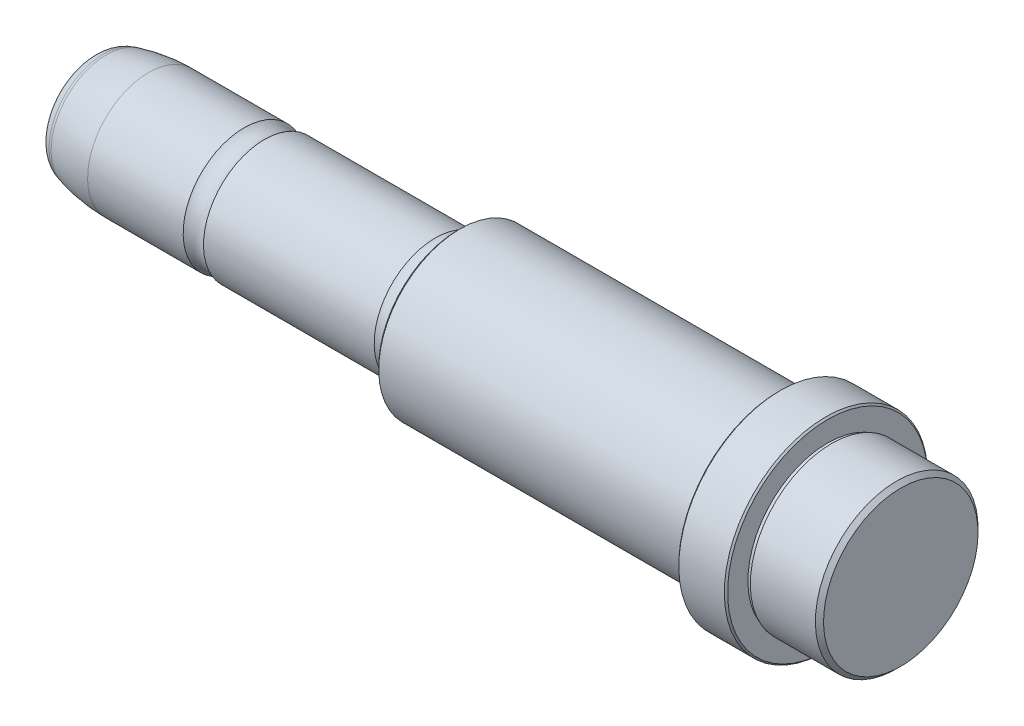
ISO-10303-21;
HEADER;
FILE_DESCRIPTION(('STEP AP214'),'2;1');
FILE_NAME('part.step','',(''),(''),'','','');
FILE_SCHEMA(('AUTOMOTIVE_DESIGN { 1 0 10303 214 1 1 1 1 }'));
ENDSEC;
DATA;
#1=APPLICATION_CONTEXT('core data for automotive mechanical design processes');
#2=APPLICATION_PROTOCOL_DEFINITION('international standard','automotive_design',2000,#1);
#3=PRODUCT_CONTEXT('',#1,'mechanical');
#4=PRODUCT('Part','Part','',(#3));
#5=PRODUCT_RELATED_PRODUCT_CATEGORY('part','',(#4));
#6=PRODUCT_DEFINITION_FORMATION('','',#4);
#7=PRODUCT_DEFINITION_CONTEXT('part definition',#1,'design');
#8=PRODUCT_DEFINITION('design','',#6,#7);
#9=PRODUCT_DEFINITION_SHAPE('','',#8);
#10=(LENGTH_UNIT() NAMED_UNIT(*) SI_UNIT(.MILLI.,.METRE.));
#11=(NAMED_UNIT(*) PLANE_ANGLE_UNIT() SI_UNIT($,.RADIAN.));
#12=(NAMED_UNIT(*) SI_UNIT($,.STERADIAN.) SOLID_ANGLE_UNIT());
#13=UNCERTAINTY_MEASURE_WITH_UNIT(LENGTH_MEASURE(1.E-05),#10,'distance_accuracy_value','');
#14=(GEOMETRIC_REPRESENTATION_CONTEXT(3) GLOBAL_UNCERTAINTY_ASSIGNED_CONTEXT((#13)) GLOBAL_UNIT_ASSIGNED_CONTEXT((#10,
#11,#12)) REPRESENTATION_CONTEXT('',''));
#15=CARTESIAN_POINT('',(0.,0.,0.));
#16=DIRECTION('',(0.,0.,1.));
#17=DIRECTION('',(1.,0.,0.));
#18=AXIS2_PLACEMENT_3D('',#15,#16,#17);
#19=CARTESIAN_POINT('',(54.7,64.7500000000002,-78.0000000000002));
#20=DIRECTION('',(1.,0.,0.));
#21=DIRECTION('',(0.,0.,-1.));
#22=AXIS2_PLACEMENT_3D('',#19,#20,#21);
#23=PLANE('',#22);
#24=CARTESIAN_POINT('',(54.7,60.0000000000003,-78.0000000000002));
#25=DIRECTION('',(1.,0.,0.));
#26=DIRECTION('',(0.,1.,0.));
#27=AXIS2_PLACEMENT_3D('',#24,#25,#26);
#28=CIRCLE('',#27,9.5);
#29=CARTESIAN_POINT('',(54.7,69.5000000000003,-78.0000000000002));
#30=VERTEX_POINT('',#29);
#31=EDGE_CURVE('E8',#30,#30,#28,.T.);
#32=ORIENTED_EDGE('',*,*,#31,.T.);
#33=EDGE_LOOP('',(#32));
#34=FACE_BOUND('',#33,.T.);
#35=ADVANCED_FACE('F12',(#34),#23,.T.);
#36=DIRECTION('',(0.707106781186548,-0.707106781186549,0.));
#37=VECTOR('',#36,1.);
#38=CARTESIAN_POINT('',(54.45,69.7500000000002,-78.0000000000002));
#39=LINE('',#38,#37);
#40=CARTESIAN_POINT('',(64.2000000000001,60.0000000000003,-78.0000000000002));
#41=DIRECTION('',(-1.,0.,0.));
#42=AXIS1_PLACEMENT('',#40,#41);
#43=SURFACE_OF_REVOLUTION('',#39,#42);
#44=CARTESIAN_POINT('',(54.2,60.0000000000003,-78.0000000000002));
#45=DIRECTION('',(1.,0.,0.));
#46=DIRECTION('',(0.,1.,0.));
#47=AXIS2_PLACEMENT_3D('',#44,#45,#46);
#48=CIRCLE('',#47,10.);
#49=CARTESIAN_POINT('',(54.2,70.0000000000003,-78.0000000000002));
#50=VERTEX_POINT('',#49);
#51=EDGE_CURVE('E85',#50,#50,#48,.T.);
#52=ORIENTED_EDGE('',*,*,#51,.T.);
#53=EDGE_LOOP('',(#52));
#54=FACE_BOUND('',#53,.T.);
#55=ORIENTED_EDGE('',*,*,#31,.F.);
#56=EDGE_LOOP('',(#55));
#57=FACE_BOUND('',#56,.T.);
#58=ADVANCED_FACE('F111',(#54,#57),#43,.F.);
#59=CARTESIAN_POINT('',(50.2,60.0000000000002,-78.0000000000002));
#60=DIRECTION('',(-1.,0.,0.));
#61=DIRECTION('',(0.,0.,1.));
#62=AXIS2_PLACEMENT_3D('',#59,#60,#61);
#63=CYLINDRICAL_SURFACE('',#62,10.);
#64=CARTESIAN_POINT('',(46.2,60.0000000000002,-78.0000000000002));
#65=DIRECTION('',(1.,0.,0.));
#66=DIRECTION('',(0.,1.,0.));
#67=AXIS2_PLACEMENT_3D('',#64,#65,#66);
#68=CIRCLE('',#67,10.);
#69=CARTESIAN_POINT('',(46.2,70.0000000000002,-78.0000000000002));
#70=VERTEX_POINT('',#69);
#71=EDGE_CURVE('E55',#70,#70,#68,.T.);
#72=ORIENTED_EDGE('',*,*,#71,.T.);
#73=EDGE_LOOP('',(#72));
#74=FACE_BOUND('',#73,.T.);
#75=ORIENTED_EDGE('',*,*,#51,.F.);
#76=EDGE_LOOP('',(#75));
#77=FACE_BOUND('',#76,.T.);
#78=ADVANCED_FACE('F115',(#74,#77),#63,.T.);
#79=CARTESIAN_POINT('',(46.2,69.9000000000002,-78.0000000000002));
#80=DIRECTION('',(-1.,0.,0.));
#81=DIRECTION('',(0.,0.,1.));
#82=AXIS2_PLACEMENT_3D('',#79,#80,#81);
#83=PLANE('',#82);
#84=CARTESIAN_POINT('',(46.2,60.0000000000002,-78.0000000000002));
#85=DIRECTION('',(1.,0.,0.));
#86=DIRECTION('',(0.,1.,0.));
#87=AXIS2_PLACEMENT_3D('',#84,#85,#86);
#88=CIRCLE('',#87,9.8);
#89=CARTESIAN_POINT('',(46.2,69.8000000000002,-78.0000000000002));
#90=VERTEX_POINT('',#89);
#91=EDGE_CURVE('E21',#90,#90,#88,.T.);
#92=ORIENTED_EDGE('',*,*,#91,.T.);
#93=EDGE_LOOP('',(#92));
#94=FACE_BOUND('',#93,.T.);
#95=ORIENTED_EDGE('',*,*,#71,.F.);
#96=EDGE_LOOP('',(#95));
#97=FACE_BOUND('',#96,.T.);
#98=ADVANCED_FACE('F119',(#94,#97),#83,.T.);
#99=CARTESIAN_POINT('',(45.95,60.0000000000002,-78.0000000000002));
#100=DIRECTION('',(-1.,0.,0.));
#101=DIRECTION('',(0.,0.,1.));
#102=AXIS2_PLACEMENT_3D('',#99,#100,#101);
#103=CYLINDRICAL_SURFACE('',#102,9.8);
#104=CARTESIAN_POINT('',(45.7,60.0000000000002,-78.0000000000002));
#105=DIRECTION('',(1.,0.,0.));
#106=DIRECTION('',(0.,1.,0.));
#107=AXIS2_PLACEMENT_3D('',#104,#105,#106);
#108=CIRCLE('',#107,9.8);
#109=CARTESIAN_POINT('',(45.7,69.8000000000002,-78.0000000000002));
#110=VERTEX_POINT('',#109);
#111=EDGE_CURVE('E30',#110,#110,#108,.T.);
#112=ORIENTED_EDGE('',*,*,#111,.T.);
#113=EDGE_LOOP('',(#112));
#114=FACE_BOUND('',#113,.T.);
#115=ORIENTED_EDGE('',*,*,#91,.F.);
#116=EDGE_LOOP('',(#115));
#117=FACE_BOUND('',#116,.T.);
#118=ADVANCED_FACE('F123',(#114,#117),#103,.T.);
#119=CARTESIAN_POINT('',(45.7,71.0500000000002,-78.0000000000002));
#120=DIRECTION('',(1.,0.,0.));
#121=DIRECTION('',(0.,0.,-1.));
#122=AXIS2_PLACEMENT_3D('',#119,#120,#121);
#123=PLANE('',#122);
#124=CARTESIAN_POINT('',(45.7,60.0000000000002,-78.0000000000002));
#125=DIRECTION('',(1.,0.,0.));
#126=DIRECTION('',(0.,1.,0.));
#127=AXIS2_PLACEMENT_3D('',#124,#125,#126);
#128=CIRCLE('',#127,12.3);
#129=CARTESIAN_POINT('',(45.7,72.3000000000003,-78.0000000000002));
#130=VERTEX_POINT('',#129);
#131=EDGE_CURVE('E40',#130,#130,#128,.T.);
#132=ORIENTED_EDGE('',*,*,#131,.T.);
#133=EDGE_LOOP('',(#132));
#134=FACE_BOUND('',#133,.T.);
#135=ORIENTED_EDGE('',*,*,#111,.F.);
#136=EDGE_LOOP('',(#135));
#137=FACE_BOUND('',#136,.T.);
#138=ADVANCED_FACE('F127',(#134,#137),#123,.T.);
#139=DIRECTION('',(0.707106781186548,-0.707106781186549,0.));
#140=VECTOR('',#139,1.);
#141=CARTESIAN_POINT('',(45.6,72.4000000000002,-78.0000000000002));
#142=LINE('',#141,#140);
#143=CARTESIAN_POINT('',(58.,60.0000000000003,-78.0000000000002));
#144=DIRECTION('',(-1.,0.,0.));
#145=AXIS1_PLACEMENT('',#143,#144);
#146=SURFACE_OF_REVOLUTION('',#142,#145);
#147=CARTESIAN_POINT('',(45.5,60.0000000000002,-78.0000000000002));
#148=DIRECTION('',(1.,0.,0.));
#149=DIRECTION('',(0.,1.,0.));
#150=AXIS2_PLACEMENT_3D('',#147,#148,#149);
#151=CIRCLE('',#150,12.5);
#152=CARTESIAN_POINT('',(45.5,72.5000000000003,-78.0000000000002));
#153=VERTEX_POINT('',#152);
#154=EDGE_CURVE('E36',#153,#153,#151,.T.);
#155=ORIENTED_EDGE('',*,*,#154,.T.);
#156=EDGE_LOOP('',(#155));
#157=FACE_BOUND('',#156,.T.);
#158=ORIENTED_EDGE('',*,*,#131,.F.);
#159=EDGE_LOOP('',(#158));
#160=FACE_BOUND('',#159,.T.);
#161=ADVANCED_FACE('F131',(#157,#160),#146,.F.);
#162=CARTESIAN_POINT('',(42.7,60.0000000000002,-78.0000000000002));
#163=DIRECTION('',(-1.,0.,0.));
#164=DIRECTION('',(0.,0.,1.));
#165=AXIS2_PLACEMENT_3D('',#162,#163,#164);
#166=CYLINDRICAL_SURFACE('',#165,12.5);
#167=CARTESIAN_POINT('',(39.9,60.0000000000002,-78.0000000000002));
#168=DIRECTION('',(1.,0.,0.));
#169=DIRECTION('',(0.,1.,0.));
#170=AXIS2_PLACEMENT_3D('',#167,#168,#169);
#171=CIRCLE('',#170,12.5);
#172=CARTESIAN_POINT('',(39.9,72.5000000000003,-78.0000000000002));
#173=VERTEX_POINT('',#172);
#174=EDGE_CURVE('E41',#173,#173,#171,.T.);
#175=ORIENTED_EDGE('',*,*,#174,.T.);
#176=EDGE_LOOP('',(#175));
#177=FACE_BOUND('',#176,.T.);
#178=ORIENTED_EDGE('',*,*,#154,.F.);
#179=EDGE_LOOP('',(#178));
#180=FACE_BOUND('',#179,.T.);
#181=ADVANCED_FACE('F135',(#177,#180),#166,.T.);
#182=DIRECTION('',(-0.707106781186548,-0.707106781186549,0.));
#183=VECTOR('',#182,1.);
#184=CARTESIAN_POINT('',(39.8,72.4000000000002,-78.0000000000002));
#185=LINE('',#184,#183);
#186=CARTESIAN_POINT('',(27.4,60.0000000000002,-78.0000000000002));
#187=DIRECTION('',(1.,0.,0.));
#188=AXIS1_PLACEMENT('',#186,#187);
#189=SURFACE_OF_REVOLUTION('',#185,#188);
#190=CARTESIAN_POINT('',(39.7,60.0000000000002,-78.0000000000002));
#191=DIRECTION('',(1.,0.,0.));
#192=DIRECTION('',(0.,1.,0.));
#193=AXIS2_PLACEMENT_3D('',#190,#191,#192);
#194=CIRCLE('',#193,12.3);
#195=CARTESIAN_POINT('',(39.7,72.3000000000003,-78.0000000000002));
#196=VERTEX_POINT('',#195);
#197=EDGE_CURVE('E51',#196,#196,#194,.T.);
#198=ORIENTED_EDGE('',*,*,#197,.T.);
#199=EDGE_LOOP('',(#198));
#200=FACE_BOUND('',#199,.T.);
#201=ORIENTED_EDGE('',*,*,#174,.F.);
#202=EDGE_LOOP('',(#201));
#203=FACE_BOUND('',#202,.T.);
#204=ADVANCED_FACE('F139',(#200,#203),#189,.F.);
#205=CARTESIAN_POINT('',(39.7,71.0500000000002,-78.0000000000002));
#206=DIRECTION('',(-1.,0.,0.));
#207=DIRECTION('',(0.,0.,1.));
#208=AXIS2_PLACEMENT_3D('',#205,#206,#207);
#209=PLANE('',#208);
#210=CARTESIAN_POINT('',(39.7,60.0000000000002,-78.0000000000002));
#211=DIRECTION('',(1.,0.,0.));
#212=DIRECTION('',(0.,1.,0.));
#213=AXIS2_PLACEMENT_3D('',#210,#211,#212);
#214=CIRCLE('',#213,9.8);
#215=CARTESIAN_POINT('',(39.7,69.8000000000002,-78.0000000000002));
#216=VERTEX_POINT('',#215);
#217=EDGE_CURVE('E45',#216,#216,#214,.T.);
#218=ORIENTED_EDGE('',*,*,#217,.T.);
#219=EDGE_LOOP('',(#218));
#220=FACE_BOUND('',#219,.T.);
#221=ORIENTED_EDGE('',*,*,#197,.F.);
#222=EDGE_LOOP('',(#221));
#223=FACE_BOUND('',#222,.T.);
#224=ADVANCED_FACE('F143',(#220,#223),#209,.T.);
#225=CARTESIAN_POINT('',(39.45,60.0000000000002,-78.0000000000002));
#226=DIRECTION('',(-1.,0.,0.));
#227=DIRECTION('',(0.,0.,1.));
#228=AXIS2_PLACEMENT_3D('',#225,#226,#227);
#229=CYLINDRICAL_SURFACE('',#228,9.8);
#230=CARTESIAN_POINT('',(39.2,60.0000000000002,-78.0000000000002));
#231=DIRECTION('',(1.,0.,0.));
#232=DIRECTION('',(0.,1.,0.));
#233=AXIS2_PLACEMENT_3D('',#230,#231,#232);
#234=CIRCLE('',#233,9.8);
#235=CARTESIAN_POINT('',(39.2,69.8000000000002,-78.0000000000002));
#236=VERTEX_POINT('',#235);
#237=EDGE_CURVE('E65',#236,#236,#234,.T.);
#238=ORIENTED_EDGE('',*,*,#237,.T.);
#239=EDGE_LOOP('',(#238));
#240=FACE_BOUND('',#239,.T.);
#241=ORIENTED_EDGE('',*,*,#217,.F.);
#242=EDGE_LOOP('',(#241));
#243=FACE_BOUND('',#242,.T.);
#244=ADVANCED_FACE('F232',(#240,#243),#229,.T.);
#245=CARTESIAN_POINT('',(39.2,69.9000000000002,-78.0000000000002));
#246=DIRECTION('',(1.,0.,0.));
#247=DIRECTION('',(0.,0.,-1.));
#248=AXIS2_PLACEMENT_3D('',#245,#246,#247);
#249=PLANE('',#248);
#250=CARTESIAN_POINT('',(39.2,60.0000000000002,-78.0000000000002));
#251=DIRECTION('',(1.,0.,0.));
#252=DIRECTION('',(0.,1.,0.));
#253=AXIS2_PLACEMENT_3D('',#250,#251,#252);
#254=CIRCLE('',#253,10.);
#255=CARTESIAN_POINT('',(39.2,70.0000000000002,-78.0000000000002));
#256=VERTEX_POINT('',#255);
#257=EDGE_CURVE('E60',#256,#256,#254,.T.);
#258=ORIENTED_EDGE('',*,*,#257,.T.);
#259=EDGE_LOOP('',(#258));
#260=FACE_BOUND('',#259,.T.);
#261=ORIENTED_EDGE('',*,*,#237,.F.);
#262=EDGE_LOOP('',(#261));
#263=FACE_BOUND('',#262,.T.);
#264=ADVANCED_FACE('F238',(#260,#263),#249,.T.);
#265=CARTESIAN_POINT('',(20.7,60.0000000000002,-78.0000000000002));
#266=DIRECTION('',(-1.,0.,0.));
#267=DIRECTION('',(0.,0.,1.));
#268=AXIS2_PLACEMENT_3D('',#265,#266,#267);
#269=CYLINDRICAL_SURFACE('',#268,10.);
#270=CARTESIAN_POINT('',(0.5,60.0000000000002,-78.0000000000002));
#271=DIRECTION('',(1.,0.,0.));
#272=DIRECTION('',(0.,1.,0.));
#273=AXIS2_PLACEMENT_3D('',#270,#271,#272);
#274=CIRCLE('',#273,10.);
#275=CARTESIAN_POINT('',(0.5,70.0000000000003,-78.0000000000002));
#276=VERTEX_POINT('',#275);
#277=EDGE_CURVE('E50',#276,#276,#274,.T.);
#278=ORIENTED_EDGE('',*,*,#277,.T.);
#279=EDGE_LOOP('',(#278));
#280=FACE_BOUND('',#279,.T.);
#281=ORIENTED_EDGE('',*,*,#257,.F.);
#282=EDGE_LOOP('',(#281));
#283=FACE_BOUND('',#282,.T.);
#284=ADVANCED_FACE('F158',(#280,#283),#269,.T.);
#285=DIRECTION('',(-0.707106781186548,-0.707106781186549,0.));
#286=VECTOR('',#285,1.);
#287=CARTESIAN_POINT('',(0.350000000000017,69.8500000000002,-78.0000000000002));
#288=LINE('',#287,#286);
#289=CARTESIAN_POINT('',(-9.49999999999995,60.0000000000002,-78.0000000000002));
#290=DIRECTION('',(1.,0.,0.));
#291=AXIS1_PLACEMENT('',#289,#290);
#292=SURFACE_OF_REVOLUTION('',#288,#291);
#293=CARTESIAN_POINT('',(0.200000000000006,60.0000000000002,-78.0000000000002));
#294=DIRECTION('',(1.,0.,0.));
#295=DIRECTION('',(0.,1.,0.));
#296=AXIS2_PLACEMENT_3D('',#293,#294,#295);
#297=CIRCLE('',#296,9.7);
#298=CARTESIAN_POINT('',(0.200000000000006,69.7000000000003,-78.0000000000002));
#299=VERTEX_POINT('',#298);
#300=EDGE_CURVE('E46',#299,#299,#297,.T.);
#301=ORIENTED_EDGE('',*,*,#300,.T.);
#302=EDGE_LOOP('',(#301));
#303=FACE_BOUND('',#302,.T.);
#304=ORIENTED_EDGE('',*,*,#277,.F.);
#305=EDGE_LOOP('',(#304));
#306=FACE_BOUND('',#305,.T.);
#307=ADVANCED_FACE('F153',(#303,#306),#292,.F.);
#308=CARTESIAN_POINT('',(0.20000000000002,69.5250000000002,-78.0000000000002));
#309=DIRECTION('',(-1.,0.,0.));
#310=DIRECTION('',(0.,0.,1.));
#311=AXIS2_PLACEMENT_3D('',#308,#309,#310);
#312=PLANE('',#311);
#313=CARTESIAN_POINT('',(0.200000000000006,60.0000000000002,-78.0000000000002));
#314=DIRECTION('',(1.,0.,0.));
#315=DIRECTION('',(0.,1.,0.));
#316=AXIS2_PLACEMENT_3D('',#313,#314,#315);
#317=CIRCLE('',#316,9.34999999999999);
#318=CARTESIAN_POINT('',(0.200000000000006,69.3500000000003,-78.0000000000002));
#319=VERTEX_POINT('',#318);
#320=EDGE_CURVE('E56',#319,#319,#317,.T.);
#321=ORIENTED_EDGE('',*,*,#320,.T.);
#322=EDGE_LOOP('',(#321));
#323=FACE_BOUND('',#322,.T.);
#324=ORIENTED_EDGE('',*,*,#300,.F.);
#325=EDGE_LOOP('',(#324));
#326=FACE_BOUND('',#325,.T.);
#327=ADVANCED_FACE('F157',(#323,#326),#312,.T.);
#328=CARTESIAN_POINT('',(-1.79999999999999,60.0000000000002,-78.0000000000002));
#329=DIRECTION('',(1.,0.,0.));
#330=DIRECTION('',(0.,0.,-1.));
#331=AXIS2_PLACEMENT_3D('',#328,#329,#330);
#332=TOROIDAL_SURFACE('',#331,9.34999999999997,2.);
#333=ORIENTED_EDGE('',*,*,#320,.F.);
#334=EDGE_LOOP('',(#333));
#335=FACE_BOUND('',#334,.T.);
#336=CARTESIAN_POINT('',(-2.55993420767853,60.0000000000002,-78.0000000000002));
#337=DIRECTION('',(1.,0.,0.));
#338=DIRECTION('',(0.,1.,0.));
#339=AXIS2_PLACEMENT_3D('',#336,#337,#338);
#340=CIRCLE('',#339,7.5);
#341=CARTESIAN_POINT('',(-2.55993420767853,67.5000000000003,-78.0000000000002));
#342=VERTEX_POINT('',#341);
#343=EDGE_CURVE('E61',#342,#342,#340,.T.);
#344=ORIENTED_EDGE('',*,*,#343,.T.);
#345=EDGE_LOOP('',(#344));
#346=FACE_BOUND('',#345,.T.);
#347=ADVANCED_FACE('F163',(#335,#346),#332,.F.);
#348=CARTESIAN_POINT('',(-13.0549671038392,60.0000000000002,-78.0000000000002));
#349=DIRECTION('',(-1.,0.,0.));
#350=DIRECTION('',(0.,0.,1.));
#351=AXIS2_PLACEMENT_3D('',#348,#349,#350);
#352=CYLINDRICAL_SURFACE('',#351,7.5);
#353=CARTESIAN_POINT('',(-23.55,60.0000000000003,-78.0000000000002));
#354=DIRECTION('',(1.,0.,0.));
#355=DIRECTION('',(0.,1.,0.));
#356=AXIS2_PLACEMENT_3D('',#353,#354,#355);
#357=CIRCLE('',#356,7.5);
#358=CARTESIAN_POINT('',(-23.55,67.5000000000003,-78.0000000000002));
#359=VERTEX_POINT('',#358);
#360=EDGE_CURVE('E72',#359,#359,#357,.T.);
#361=ORIENTED_EDGE('',*,*,#360,.T.);
#362=EDGE_LOOP('',(#361));
#363=FACE_BOUND('',#362,.T.);
#364=ORIENTED_EDGE('',*,*,#343,.F.);
#365=EDGE_LOOP('',(#364));
#366=FACE_BOUND('',#365,.T.);
#367=ADVANCED_FACE('F167',(#363,#366),#352,.T.);
#368=CARTESIAN_POINT('',(-24.8,60.0000000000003,-78.0000000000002));
#369=DIRECTION('',(1.,0.,0.));
#370=DIRECTION('',(0.,0.,-1.));
#371=AXIS2_PLACEMENT_3D('',#368,#369,#370);
#372=TOROIDAL_SURFACE('',#371,9.31038669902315,2.2);
#373=ORIENTED_EDGE('',*,*,#360,.F.);
#374=EDGE_LOOP('',(#373));
#375=FACE_BOUND('',#374,.T.);
#376=CARTESIAN_POINT('',(-26.05,60.0000000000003,-78.0000000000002));
#377=DIRECTION('',(1.,0.,0.));
#378=DIRECTION('',(0.,1.,0.));
#379=AXIS2_PLACEMENT_3D('',#376,#377,#378);
#380=CIRCLE('',#379,7.5);
#381=CARTESIAN_POINT('',(-26.05,67.5000000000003,-78.0000000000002));
#382=VERTEX_POINT('',#381);
#383=EDGE_CURVE('E68',#382,#382,#380,.T.);
#384=ORIENTED_EDGE('',*,*,#383,.T.);
#385=EDGE_LOOP('',(#384));
#386=FACE_BOUND('',#385,.T.);
#387=ADVANCED_FACE('F171',(#375,#386),#372,.F.);
#388=CARTESIAN_POINT('',(-31.925,60.0000000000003,-78.0000000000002));
#389=DIRECTION('',(-1.,0.,0.));
#390=DIRECTION('',(0.,0.,1.));
#391=AXIS2_PLACEMENT_3D('',#388,#389,#390);
#392=CYLINDRICAL_SURFACE('',#391,7.5);
#393=CARTESIAN_POINT('',(-37.8,60.0000000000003,-78.0000000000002));
#394=DIRECTION('',(1.,0.,0.));
#395=DIRECTION('',(0.,1.,0.));
#396=AXIS2_PLACEMENT_3D('',#393,#394,#395);
#397=CIRCLE('',#396,7.5);
#398=CARTESIAN_POINT('',(-37.8,67.5000000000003,-78.0000000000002));
#399=VERTEX_POINT('',#398);
#400=EDGE_CURVE('E33',#399,#399,#397,.T.);
#401=ORIENTED_EDGE('',*,*,#400,.T.);
#402=EDGE_LOOP('',(#401));
#403=FACE_BOUND('',#402,.T.);
#404=ORIENTED_EDGE('',*,*,#383,.F.);
#405=EDGE_LOOP('',(#404));
#406=FACE_BOUND('',#405,.T.);
#407=ADVANCED_FACE('F175',(#403,#406),#392,.T.);
#408=CARTESIAN_POINT('',(-37.7999999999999,60.0000000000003,-65.5000000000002));
#409=DIRECTION('',(0.,1.,0.));
#410=DIRECTION('',(0.,0.,-1.));
#411=AXIS2_PLACEMENT_3D('',#408,#409,#410);
#412=CIRCLE('',#411,20.);
#413=TRIMMED_CURVE('',#412,(PARAMETER_VALUE(-0.895664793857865)),
(PARAMETER_VALUE(0.895664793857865)),.T.,.PARAMETER.);
#414=CARTESIAN_POINT('',(-37.8,60.0000000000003,-78.0000000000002));
#415=DIRECTION('',(1.,0.,0.));
#416=AXIS1_PLACEMENT('',#414,#415);
#417=SURFACE_OF_REVOLUTION('',#413,#416);
#418=CARTESIAN_POINT('',(-42.9763809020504,60.0000000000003,-78.0000000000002));
#419=DIRECTION('',(1.,0.,0.));
#420=DIRECTION('',(0.,1.,0.));
#421=AXIS2_PLACEMENT_3D('',#418,#419,#420);
#422=CIRCLE('',#421,6.81851652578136);
#423=CARTESIAN_POINT('',(-42.9763809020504,66.8185165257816,-78.0000000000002));
#424=VERTEX_POINT('',#423);
#425=EDGE_CURVE('E78',#424,#424,#422,.T.);
#426=ORIENTED_EDGE('',*,*,#425,.T.);
#427=EDGE_LOOP('',(#426));
#428=FACE_BOUND('',#427,.T.);
#429=ORIENTED_EDGE('',*,*,#400,.F.);
#430=EDGE_LOOP('',(#429));
#431=FACE_BOUND('',#430,.T.);
#432=ADVANCED_FACE('F182',(#428,#431),#417,.F.);
#433=DIRECTION('',(-0.965925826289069,-0.25881904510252,0.));
#434=VECTOR('',#433,1.);
#435=CARTESIAN_POINT('',(499000.,133784.981026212,-78.0000000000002));
#436=LINE('',#435,#434);
#437=CARTESIAN_POINT('',(-68.4234310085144,60.0000000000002,-78.0000000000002));
#438=DIRECTION('',(1.,0.,0.));
#439=AXIS1_PLACEMENT('',#437,#438);
#440=SURFACE_OF_REVOLUTION('',#436,#439);
#441=CARTESIAN_POINT('',(-43.317638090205,60.0000000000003,-78.0000000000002));
#442=DIRECTION('',(1.,0.,0.));
#443=DIRECTION('',(0.,1.,0.));
#444=AXIS2_PLACEMENT_3D('',#441,#442,#443);
#445=CIRCLE('',#444,6.72707693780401);
#446=CARTESIAN_POINT('',(-43.317638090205,66.7270769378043,-78.0000000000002));
#447=VERTEX_POINT('',#446);
#448=EDGE_CURVE('E74',#447,#447,#445,.T.);
#449=ORIENTED_EDGE('',*,*,#448,.T.);
#450=EDGE_LOOP('',(#449));
#451=FACE_BOUND('',#450,.T.);
#452=ORIENTED_EDGE('',*,*,#425,.F.);
#453=EDGE_LOOP('',(#452));
#454=FACE_BOUND('',#453,.T.);
#455=ADVANCED_FACE('F185',(#451,#454),#440,.F.);
#456=CARTESIAN_POINT('',(-42.8,60.0000000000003,-78.0000000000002));
#457=DIRECTION('',(1.,0.,0.));
#458=DIRECTION('',(0.,0.,-1.));
#459=AXIS2_PLACEMENT_3D('',#456,#457,#458);
#460=TOROIDAL_SURFACE('',#459,4.79522528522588,2.);
#461=CARTESIAN_POINT('',(-44.8,60.0000000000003,-78.0000000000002));
#462=DIRECTION('',(1.,0.,0.));
#463=DIRECTION('',(0.,1.,0.));
#464=AXIS2_PLACEMENT_3D('',#461,#462,#463);
#465=CIRCLE('',#464,4.79522528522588);
#466=CARTESIAN_POINT('',(-44.8,64.7952252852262,-78.0000000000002));
#467=VERTEX_POINT('',#466);
#468=EDGE_CURVE('E73',#467,#467,#465,.T.);
#469=ORIENTED_EDGE('',*,*,#468,.T.);
#470=EDGE_LOOP('',(#469));
#471=FACE_BOUND('',#470,.T.);
#472=ORIENTED_EDGE('',*,*,#448,.F.);
#473=EDGE_LOOP('',(#472));
#474=FACE_BOUND('',#473,.T.);
#475=ADVANCED_FACE('F188',(#471,#474),#460,.T.);
#476=CARTESIAN_POINT('',(-44.8,62.3976126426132,-78.0000000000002));
#477=DIRECTION('',(-1.,0.,0.));
#478=DIRECTION('',(0.,0.,1.));
#479=AXIS2_PLACEMENT_3D('',#476,#477,#478);
#480=PLANE('',#479);
#481=ORIENTED_EDGE('',*,*,#468,.F.);
#482=EDGE_LOOP('',(#481));
#483=FACE_BOUND('',#482,.T.);
#484=ADVANCED_FACE('F14',(#483),#480,.T.);
#485=CLOSED_SHELL('',(#35,#58,#78,#98,#118,#138,#161,#181,#204,#224,#244,#264,#284,#307,#327,
#347,#367,#387,#407,#432,#455,#475,#484));
#486=MANIFOLD_SOLID_BREP('B1',#485);
#487=ADVANCED_BREP_SHAPE_REPRESENTATION('',(#18,#486),#14);
#488=SHAPE_DEFINITION_REPRESENTATION(#9,#487);
ENDSEC;
END-ISO-10303-21;
